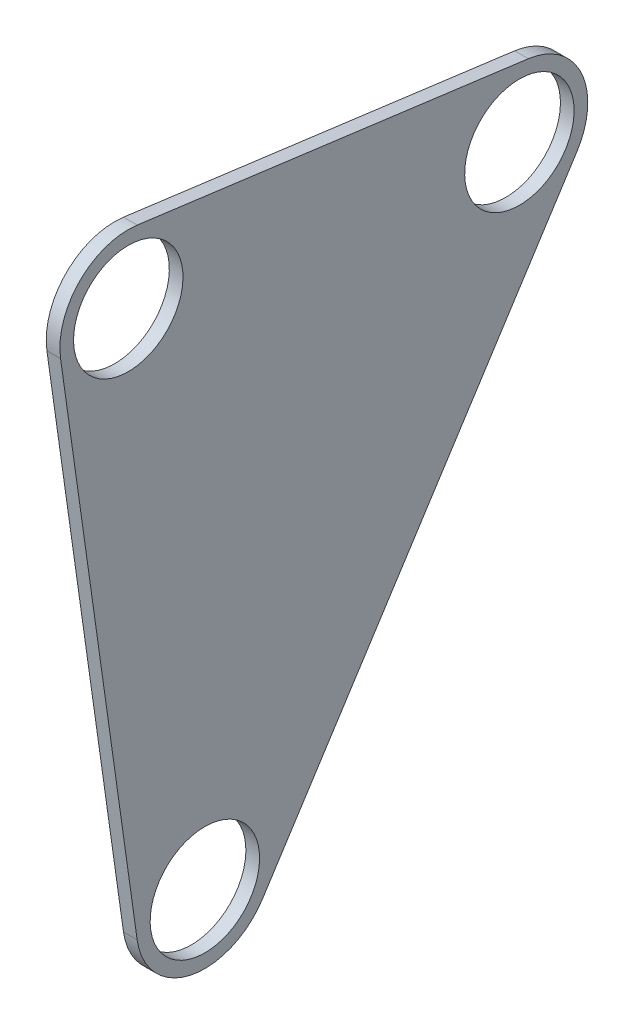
from build123d import *

# Parameters (mm, degrees)
ESQUISSE2_R        = 10
BOSS_EXTRU_2_DEPTH = 2.5


with BuildPart() as part:
    # Esquisse2 → Boss.-Extru.2 (new body)
    with BuildSketch(Plane(origin=(523.40938789, 0, 0), x_dir=(0, 0, -1), z_dir=(1, 0, 0))):
        with BuildLine():
            Line((-1443.449392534, 1242.611420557), (-1457.449392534, 1341.626570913))
            ThreePointArc((-1457.449392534, 1341.626570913), (-1453.953489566, 1352.173047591), (-1443.440921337, 1355.76963168))
            Line((-1443.440921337, 1355.76963168), (-1371.940921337, 1346.356478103))
            ThreePointArc((-1371.940921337, 1346.356478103), (-1362.234936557, 1339.227416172), (-1363.052361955, 1327.212363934))
            Line((-1363.052361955, 1327.212363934), (-1420.552361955, 1237.610367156))
            ThreePointArc((-1420.552361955, 1237.610367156), (-1433.739804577, 1232.149316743), (-1443.449392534, 1242.611420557))
        make_face()
        with Locations(Location((-1445.07249874, 1343.376570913, 0), (0, 0, 90))):
            Circle(ESQUISSE2_R, mode=Mode.SUBTRACT)
        with Locations(Location((-1373.57249874, 1333.963417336, 0), (0, 0, 90))):
            Circle(ESQUISSE2_R, mode=Mode.SUBTRACT)
        with Locations(Location((-1431.07249874, 1244.361420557, 0), (0, 0, 90))):
            Circle(ESQUISSE2_R, mode=Mode.SUBTRACT)
    extrude(amount=BOSS_EXTRU_2_DEPTH)


solid = part.part
